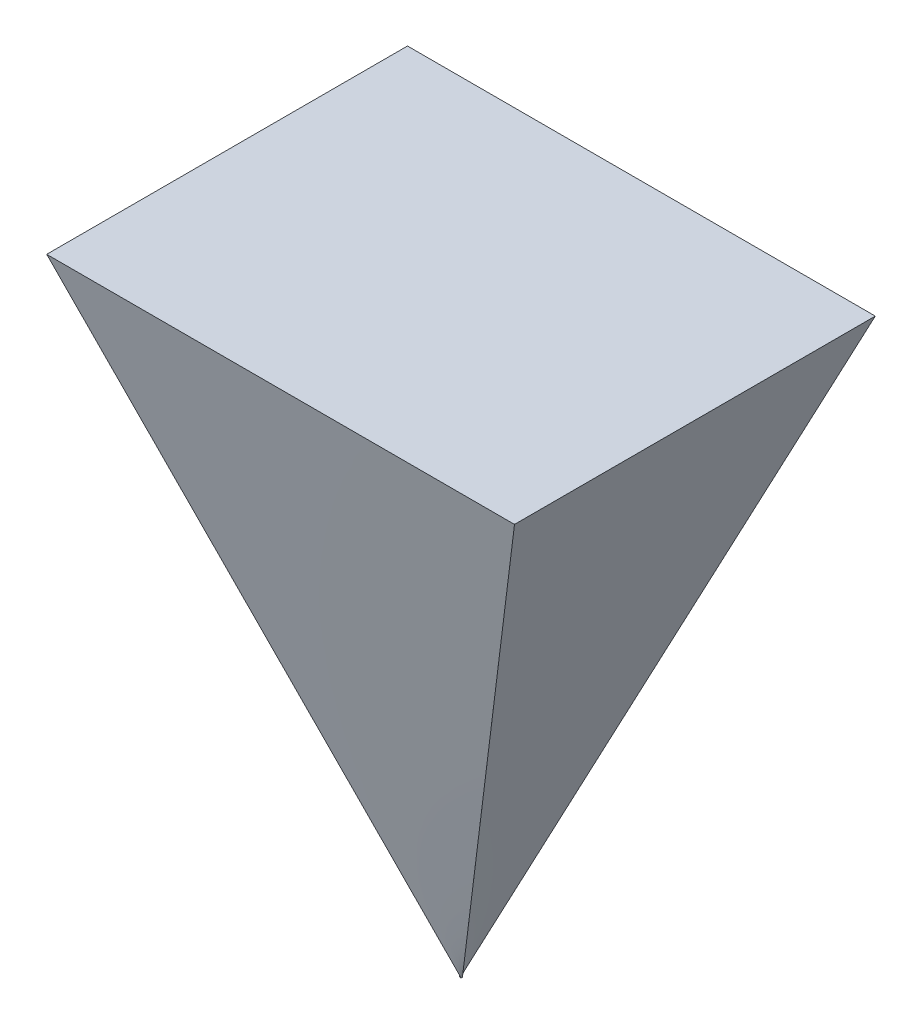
ISO-10303-21;
HEADER;
FILE_DESCRIPTION(('STEP AP214'),'2;1');
FILE_NAME('part.step','',(''),(''),'','','');
FILE_SCHEMA(('AUTOMOTIVE_DESIGN { 1 0 10303 214 1 1 1 1 }'));
ENDSEC;
DATA;
#1=APPLICATION_CONTEXT('core data for automotive mechanical design processes');
#2=APPLICATION_PROTOCOL_DEFINITION('international standard','automotive_design',2000,#1);
#3=PRODUCT_CONTEXT('',#1,'mechanical');
#4=PRODUCT('Part','Part','',(#3));
#5=PRODUCT_RELATED_PRODUCT_CATEGORY('part','',(#4));
#6=PRODUCT_DEFINITION_FORMATION('','',#4);
#7=PRODUCT_DEFINITION_CONTEXT('part definition',#1,'design');
#8=PRODUCT_DEFINITION('design','',#6,#7);
#9=PRODUCT_DEFINITION_SHAPE('','',#8);
#10=(LENGTH_UNIT() NAMED_UNIT(*) SI_UNIT(.MILLI.,.METRE.));
#11=(NAMED_UNIT(*) PLANE_ANGLE_UNIT() SI_UNIT($,.RADIAN.));
#12=(NAMED_UNIT(*) SI_UNIT($,.STERADIAN.) SOLID_ANGLE_UNIT());
#13=UNCERTAINTY_MEASURE_WITH_UNIT(LENGTH_MEASURE(1.E-05),#10,'distance_accuracy_value','');
#14=(GEOMETRIC_REPRESENTATION_CONTEXT(3) GLOBAL_UNCERTAINTY_ASSIGNED_CONTEXT((#13)) GLOBAL_UNIT_ASSIGNED_CONTEXT((#10,
#11,#12)) REPRESENTATION_CONTEXT('',''));
#15=CARTESIAN_POINT('',(0.,0.,0.));
#16=DIRECTION('',(0.,0.,1.));
#17=DIRECTION('',(1.,0.,0.));
#18=AXIS2_PLACEMENT_3D('',#15,#16,#17);
#19=CARTESIAN_POINT('',(1943.1,4978.4,-1498.6));
#20=DIRECTION('',(0.,1.,0.));
#21=DIRECTION('',(0.,0.,1.));
#22=AXIS2_PLACEMENT_3D('',#19,#20,#21);
#23=PLANE('',#22);
#24=DIRECTION('',(0.,0.,-1.));
#25=VECTOR('',#24,1.);
#26=CARTESIAN_POINT('',(1943.1,4978.4,1498.6));
#27=LINE('',#26,#25);
#28=CARTESIAN_POINT('',(1943.1,4978.4,1498.6));
#29=VERTEX_POINT('',#28);
#30=CARTESIAN_POINT('',(1943.1,4978.4,-1498.6));
#31=VERTEX_POINT('',#30);
#32=EDGE_CURVE('E135',#29,#31,#27,.T.);
#33=ORIENTED_EDGE('',*,*,#32,.T.);
#34=DIRECTION('',(-1.,0.,0.));
#35=VECTOR('',#34,1.);
#36=CARTESIAN_POINT('',(1943.1,4978.4,-1498.6));
#37=LINE('',#36,#35);
#38=CARTESIAN_POINT('',(-1943.1,4978.4,-1498.6));
#39=VERTEX_POINT('',#38);
#40=EDGE_CURVE('E108',#31,#39,#37,.T.);
#41=ORIENTED_EDGE('',*,*,#40,.T.);
#42=DIRECTION('',(0.,0.,1.));
#43=VECTOR('',#42,1.);
#44=CARTESIAN_POINT('',(-1943.1,4978.4,1498.6));
#45=LINE('',#44,#43);
#46=CARTESIAN_POINT('',(-1943.1,4978.4,1498.6));
#47=VERTEX_POINT('',#46);
#48=EDGE_CURVE('E89',#39,#47,#45,.T.);
#49=ORIENTED_EDGE('',*,*,#48,.T.);
#50=DIRECTION('',(1.,0.,0.));
#51=VECTOR('',#50,1.);
#52=CARTESIAN_POINT('',(1943.1,4978.4,1498.6));
#53=LINE('',#52,#51);
#54=EDGE_CURVE('E80',#47,#29,#53,.T.);
#55=ORIENTED_EDGE('',*,*,#54,.T.);
#56=EDGE_LOOP('',(#33,#41,#49,#55));
#57=FACE_BOUND('',#56,.T.);
#58=ADVANCED_FACE('F41',(#57),#23,.T.);
#59=CARTESIAN_POINT('',(-6.477,0.,5.334));
#60=DIRECTION('',(0.,1.,0.));
#61=DIRECTION('',(0.,0.,1.));
#62=AXIS2_PLACEMENT_3D('',#59,#60,#61);
#63=PLANE('',#62);
#64=DIRECTION('',(0.,0.,1.));
#65=VECTOR('',#64,1.);
#66=CARTESIAN_POINT('',(-6.477,0.,-5.3086));
#67=LINE('',#66,#65);
#68=CARTESIAN_POINT('',(-6.477,0.,-5.3086));
#69=VERTEX_POINT('',#68);
#70=CARTESIAN_POINT('',(-6.477,0.,5.334));
#71=VERTEX_POINT('',#70);
#72=EDGE_CURVE('E198',#69,#71,#67,.T.);
#73=ORIENTED_EDGE('',*,*,#72,.F.);
#74=DIRECTION('',(-1.,0.,0.));
#75=VECTOR('',#74,1.);
#76=CARTESIAN_POINT('',(-6.477,0.,-5.3086));
#77=LINE('',#76,#75);
#78=CARTESIAN_POINT('',(6.477,0.,-5.3086));
#79=VERTEX_POINT('',#78);
#80=EDGE_CURVE('E12',#79,#69,#77,.T.);
#81=ORIENTED_EDGE('',*,*,#80,.F.);
#82=DIRECTION('',(0.,0.,-1.));
#83=VECTOR('',#82,1.);
#84=CARTESIAN_POINT('',(6.477,0.,-5.3086));
#85=LINE('',#84,#83);
#86=CARTESIAN_POINT('',(6.477,0.,5.334));
#87=VERTEX_POINT('',#86);
#88=EDGE_CURVE('E52',#87,#79,#85,.T.);
#89=ORIENTED_EDGE('',*,*,#88,.F.);
#90=DIRECTION('',(1.,0.,0.));
#91=VECTOR('',#90,1.);
#92=CARTESIAN_POINT('',(-6.477,0.,5.334));
#93=LINE('',#92,#91);
#94=EDGE_CURVE('E61',#71,#87,#93,.T.);
#95=ORIENTED_EDGE('',*,*,#94,.F.);
#96=EDGE_LOOP('',(#73,#81,#89,#95));
#97=FACE_BOUND('',#96,.T.);
#98=ADVANCED_FACE('F220',(#97),#63,.F.);
#99=CARTESIAN_POINT('',(6.477,0.,5.334));
#100=CARTESIAN_POINT('',(-1943.1,4978.4,1498.6));
#101=CARTESIAN_POINT('',(6.477,0.,3.56023333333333));
#102=CARTESIAN_POINT('',(-1295.4,4978.4,1498.6));
#103=CARTESIAN_POINT('',(6.477,0.,1.78646666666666));
#104=CARTESIAN_POINT('',(-647.699999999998,4978.4,1498.6));
#105=CARTESIAN_POINT('',(6.477,0.,-1.76106666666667));
#106=CARTESIAN_POINT('',(647.700000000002,4978.4,1498.6));
#107=CARTESIAN_POINT('',(6.477,0.,-3.53483333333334));
#108=CARTESIAN_POINT('',(1295.4,4978.4,1498.6));
#109=CARTESIAN_POINT('',(6.477,0.,-5.3086));
#110=CARTESIAN_POINT('',(1943.1,4978.4,1498.6));
#111=B_SPLINE_SURFACE_WITH_KNOTS('',3,1,((#99,#100),(#101,#102),(#103,#104),(#105,#106),(#107,
#108),(#109,#110)),.UNSPECIFIED.,.F.,.F.,.F.,(4,2,4),(2,2),(0.,0.5,1.),(0.,1.),.UNSPECIFIED.);
#112=DIRECTION('',(0.348973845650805,0.897093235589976,0.270999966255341));
#113=VECTOR('',#112,1.);
#114=CARTESIAN_POINT('',(974.7885,2489.2,746.6457));
#115=LINE('',#114,#113);
#116=EDGE_CURVE('E95',#79,#29,#115,.T.);
#117=DIRECTION('',(0.351202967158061,-0.896824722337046,-0.269001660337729));
#118=VECTOR('',#117,1.);
#119=CARTESIAN_POINT('',(-968.311499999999,2489.2,751.967));
#120=LINE('',#119,#118);
#121=EDGE_CURVE('E86',#47,#87,#120,.T.);
#122=ORIENTED_EDGE('',*,*,#88,.T.);
#123=ORIENTED_EDGE('',*,*,#116,.T.);
#124=ORIENTED_EDGE('',*,*,#54,.F.);
#125=ORIENTED_EDGE('',*,*,#121,.T.);
#126=EDGE_LOOP('',(#122,#123,#124,#125));
#127=FACE_BOUND('',#126,.T.);
#128=ADVANCED_FACE('F100',(#127),#111,.T.);
#129=CARTESIAN_POINT('',(6.477,0.,-5.3086));
#130=CARTESIAN_POINT('',(1943.1,4978.4,1498.6));
#131=CARTESIAN_POINT('',(4.31800000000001,0.,-5.3086));
#132=CARTESIAN_POINT('',(1943.1,4978.4,999.066666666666));
#133=CARTESIAN_POINT('',(2.15900000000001,0.,-5.3086));
#134=CARTESIAN_POINT('',(1943.1,4978.4,499.533333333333));
#135=CARTESIAN_POINT('',(-2.15899999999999,0.,-5.3086));
#136=CARTESIAN_POINT('',(1943.1,4978.4,-499.533333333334));
#137=CARTESIAN_POINT('',(-4.31799999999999,0.,-5.3086));
#138=CARTESIAN_POINT('',(1943.1,4978.4,-999.066666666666));
#139=CARTESIAN_POINT('',(-6.477,0.,-5.3086));
#140=CARTESIAN_POINT('',(1943.1,4978.4,-1498.6));
#141=B_SPLINE_SURFACE_WITH_KNOTS('',3,1,((#129,#130),(#131,#132),(#133,#134),(#135,#136),(#137,
#138),(#139,#140)),.UNSPECIFIED.,.F.,.F.,.F.,(4,2,4),(2,2),(0.,0.5,1.),(0.,1.),.UNSPECIFIED.);
#142=DIRECTION('',(0.351202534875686,0.896823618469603,-0.269005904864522));
#143=VECTOR('',#142,1.);
#144=CARTESIAN_POINT('',(968.3115,2489.2,-751.9543));
#145=LINE('',#144,#143);
#146=EDGE_CURVE('E96',#69,#31,#145,.T.);
#147=ORIENTED_EDGE('',*,*,#80,.T.);
#148=ORIENTED_EDGE('',*,*,#146,.T.);
#149=ORIENTED_EDGE('',*,*,#32,.F.);
#150=ORIENTED_EDGE('',*,*,#116,.F.);
#151=EDGE_LOOP('',(#147,#148,#149,#150));
#152=FACE_BOUND('',#151,.T.);
#153=ADVANCED_FACE('F154',(#152),#141,.T.);
#154=CARTESIAN_POINT('',(-6.477,0.,5.334));
#155=CARTESIAN_POINT('',(-1943.1,4978.4,-1498.6));
#156=CARTESIAN_POINT('',(-4.318,0.,5.334));
#157=CARTESIAN_POINT('',(-1943.1,4978.4,-999.066666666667));
#158=CARTESIAN_POINT('',(-2.159,0.,5.334));
#159=CARTESIAN_POINT('',(-1943.1,4978.4,-499.533333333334));
#160=CARTESIAN_POINT('',(2.159,0.,5.334));
#161=CARTESIAN_POINT('',(-1943.1,4978.4,499.533333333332));
#162=CARTESIAN_POINT('',(4.318,0.,5.334));
#163=CARTESIAN_POINT('',(-1943.1,4978.4,999.066666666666));
#164=CARTESIAN_POINT('',(6.477,0.,5.334));
#165=CARTESIAN_POINT('',(-1943.1,4978.4,1498.6));
#166=B_SPLINE_SURFACE_WITH_KNOTS('',3,1,((#154,#155),(#156,#157),(#158,#159),(#160,#161),(#162,
#163),(#164,#165)),.UNSPECIFIED.,.F.,.F.,.F.,(4,2,4),(2,2),(0.,0.5,1.),(0.,1.),.UNSPECIFIED.);
#167=DIRECTION('',(-0.34897341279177,0.89709212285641,-0.271004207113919));
#168=VECTOR('',#167,1.);
#169=CARTESIAN_POINT('',(-974.7885,2489.2,-746.633));
#170=LINE('',#169,#168);
#171=EDGE_CURVE('E102',#71,#39,#170,.T.);
#172=ORIENTED_EDGE('',*,*,#94,.T.);
#173=ORIENTED_EDGE('',*,*,#121,.F.);
#174=ORIENTED_EDGE('',*,*,#48,.F.);
#175=ORIENTED_EDGE('',*,*,#171,.F.);
#176=EDGE_LOOP('',(#172,#173,#174,#175));
#177=FACE_BOUND('',#176,.T.);
#178=ADVANCED_FACE('F87',(#177),#166,.T.);
#179=CARTESIAN_POINT('',(-6.477,0.,-5.3086));
#180=CARTESIAN_POINT('',(1943.1,4978.4,-1498.6));
#181=CARTESIAN_POINT('',(-6.477,0.,-3.53483333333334));
#182=CARTESIAN_POINT('',(1295.4,4978.4,-1498.6));
#183=CARTESIAN_POINT('',(-6.477,0.,-1.76106666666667));
#184=CARTESIAN_POINT('',(647.700000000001,4978.4,-1498.6));
#185=CARTESIAN_POINT('',(-6.477,0.,1.78646666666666));
#186=CARTESIAN_POINT('',(-647.699999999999,4978.4,-1498.6));
#187=CARTESIAN_POINT('',(-6.477,0.,3.56023333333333));
#188=CARTESIAN_POINT('',(-1295.4,4978.4,-1498.6));
#189=CARTESIAN_POINT('',(-6.477,0.,5.334));
#190=CARTESIAN_POINT('',(-1943.1,4978.4,-1498.6));
#191=B_SPLINE_SURFACE_WITH_KNOTS('',3,1,((#179,#180),(#181,#182),(#183,#184),(#185,#186),(#187,
#188),(#189,#190)),.UNSPECIFIED.,.F.,.F.,.F.,(4,2,4),(2,2),(0.,0.5,1.),(0.,1.),.UNSPECIFIED.);
#192=ORIENTED_EDGE('',*,*,#72,.T.);
#193=ORIENTED_EDGE('',*,*,#171,.T.);
#194=ORIENTED_EDGE('',*,*,#40,.F.);
#195=ORIENTED_EDGE('',*,*,#146,.F.);
#196=EDGE_LOOP('',(#192,#193,#194,#195));
#197=FACE_BOUND('',#196,.T.);
#198=ADVANCED_FACE('F210',(#197),#191,.T.);
#199=CLOSED_SHELL('',(#58,#98,#128,#153,#178,#198));
#200=MANIFOLD_SOLID_BREP('B2',#199);
#201=ADVANCED_BREP_SHAPE_REPRESENTATION('',(#18,#200),#14);
#202=SHAPE_DEFINITION_REPRESENTATION(#9,#201);
ENDSEC;
END-ISO-10303-21;
